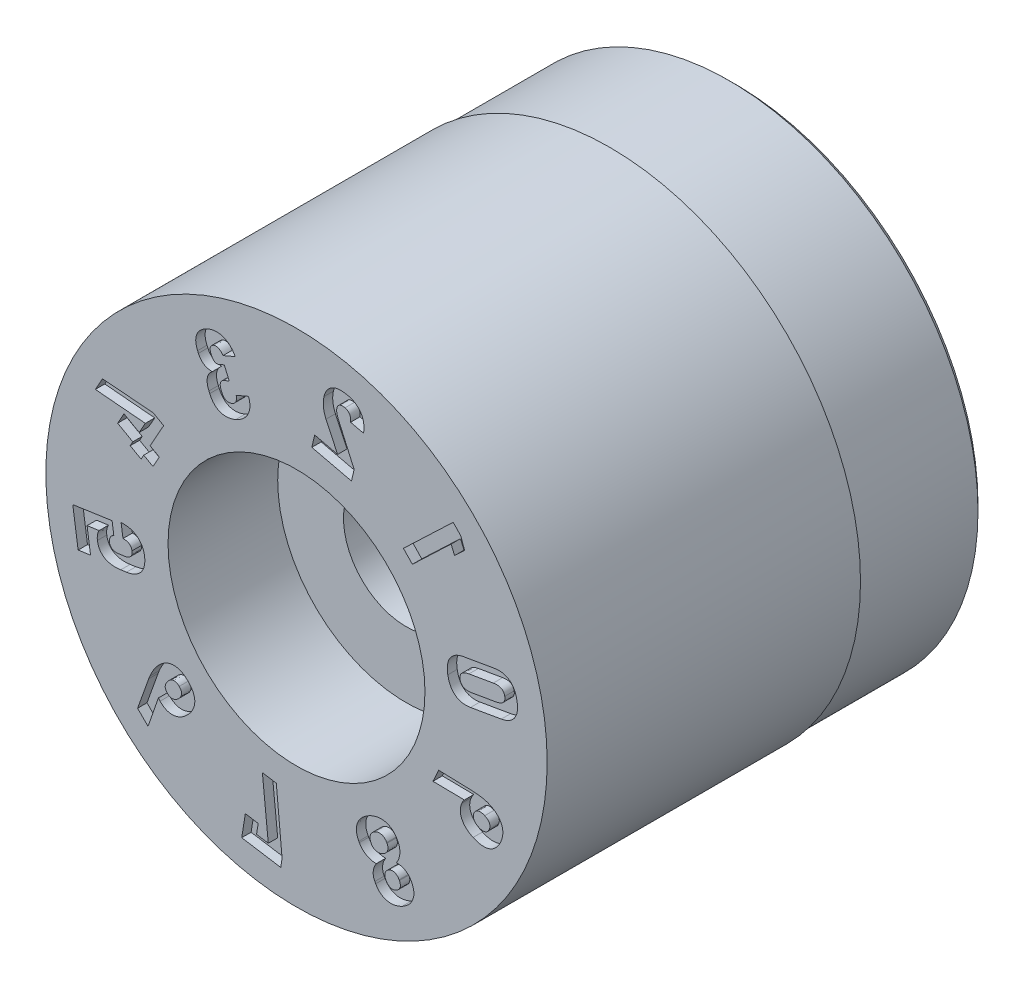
from build123d import *

# Parameters (mm, degrees)
SKETCH4_W          = 4
SKETCH4_H          = 1
CUT_EXTRUDE1_DEPTH = 0.3


with BuildPart() as part:
    # Sketch1 → Revolve1 (revolve)
    with BuildSketch(Plane(origin=(0, 0, 0), x_dir=(0, 0, -1), z_dir=(1, 0, 0)), mode=Mode.PRIVATE) as revolve1_sk:
        Polygon((0, 8), (0, 4.1), (3.5, 4.1), (3.5, 2), (14, 2), (14, 7.75), (13.75, 8), align=None)
    revolve(revolve1_sk.sketch.rotate(Axis((0, 0, 3.797909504), (0, 0, -1)), 90), axis=Axis((0, 0, 3.797909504), (0, 0, -1)))

    # Sketch4 → Cut-Revolve1 (revolve, cut)
    with BuildSketch(Plane(origin=(0, 0, 0), x_dir=(0, 0, -1), z_dir=(1, 0, 0)), mode=Mode.PRIVATE) as cut_revolve1_sk:
        with Locations((12, 8.435)):
            Rectangle(SKETCH4_W, SKETCH4_H)
    revolve(cut_revolve1_sk.sketch.rotate(Axis((0, 0, 0), (0, 0, -1)), 90), axis=Axis((0, 0, 0), (0, 0, -1)), mode=Mode.SUBTRACT)

    # Sketch6 → Cut-Extrude1 (cut)
    # profile 1 of 10: a face of its own
    with BuildSketch(Plane.XY):
        with BuildLine():
            Line((5.55422634, 0.29551817), (6.536308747, 0.465519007))
            add(Edge.make_bspline(
                [(6.536308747, 0.465519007), (6.582358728, 0.47294096), (6.648610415, 0.490139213), (6.73196451, 0.521902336), (6.787499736, 0.550627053), (6.838593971, 0.583022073), (6.884339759, 0.620402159), (6.925017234, 0.6625439), (6.961045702, 0.708597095), (6.991143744, 0.759268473), (7.015701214, 0.813627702), (7.034714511, 0.871713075), (7.0473586, 0.933811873), (7.053299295, 0.999644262), (7.055657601, 1.095087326), (7.046878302, 1.168307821), (7.038245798, 1.217849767)],
                knots=[0, 0, 0, 0, 0.135673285, 0.19880589, 0.259376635, 0.317443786, 0.37470943, 0.43096218, 0.487709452, 0.544606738, 0.602164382, 0.661102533, 0.72223516, 0.786286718, 0.853375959, 1, 1, 1, 1], degree=3))
            add(Edge.make_bspline(
                [(7.038245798, 1.217849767), (7.02979219, 1.267531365), (7.012248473, 1.339109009), (6.9800434, 1.429112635), (6.951379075, 1.488843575), (6.918790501, 1.543126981), (6.881684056, 1.59179115), (6.840526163, 1.635003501), (6.7949774, 1.672246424), (6.746085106, 1.703965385), (6.693537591, 1.729208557), (6.638054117, 1.749256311), (6.579026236, 1.762788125), (6.516850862, 1.77062367), (6.427393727, 1.772882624), (6.358867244, 1.766620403), (6.312715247, 1.757966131)],
                knots=[0, 0, 0, 0, 0.146552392, 0.213951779, 0.277770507, 0.338999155, 0.397856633, 0.45547227, 0.512221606, 0.568665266, 0.624627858, 0.681472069, 0.739968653, 0.800446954, 0.863510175, 1, 1, 1, 1], degree=3))
            Line((6.312715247, 1.757966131), (5.33063284, 1.587965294))
            add(Edge.make_bspline(
                [(5.33063284, 1.587965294), (5.28458286, 1.58054334), (5.218331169, 1.56334509), (5.134977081, 1.531581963), (5.079441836, 1.502857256), (5.028347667, 1.470462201), (4.98260164, 1.433082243), (4.941925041, 1.390940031), (4.905893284, 1.344888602), (4.875807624, 1.29421058), (4.85115414, 1.239768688), (4.832329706, 1.181538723), (4.820526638, 1.119352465), (4.813176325, 1.053715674), (4.812623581, 0.958327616), (4.820200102, 0.88521742), (4.829117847, 0.835785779)],
                knots=[0, 0, 0, 0, 0.135708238, 0.198857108, 0.259443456, 0.317525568, 0.374805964, 0.431073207, 0.487835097, 0.544747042, 0.602319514, 0.661617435, 0.722540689, 0.786404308, 0.853764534, 1, 1, 1, 1], degree=3))
            add(Edge.make_bspline(
                [(4.829117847, 0.835785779), (4.838187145, 0.78611769), (4.854327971, 0.713961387), (4.887481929, 0.624066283), (4.916676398, 0.564608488), (4.949042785, 0.510110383), (4.986719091, 0.461722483), (5.028265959, 0.418648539), (5.074229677, 0.381528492), (5.123702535, 0.350054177), (5.176323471, 0.324468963), (5.232129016, 0.30495926), (5.290886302, 0.291361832), (5.352626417, 0.283435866), (5.441042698, 0.280389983), (5.508626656, 0.287790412), (5.55422634, 0.29551817)],
                knots=[0, 0, 0, 0, 0.147216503, 0.214711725, 0.278663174, 0.339975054, 0.399045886, 0.45691866, 0.513969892, 0.570756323, 0.627410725, 0.68405676, 0.742632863, 0.802805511, 0.865144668, 1, 1, 1, 1], degree=3))
        make_face()
        with BuildLine():
            Line((5.505245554, 1.199046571), (6.279393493, 1.332634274))
            add(Edge.make_bspline(
                [(6.279393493, 1.332634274), (6.326021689, 1.340144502), (6.393686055, 1.347712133), (6.47836893, 1.336043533), (6.522573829, 1.321790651), (6.553354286, 1.305661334), (6.573406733, 1.290647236), (6.591713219, 1.273714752), (6.607443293, 1.253805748), (6.620543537, 1.231241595), (6.636122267, 1.197383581), (6.642976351, 1.169450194), (6.646226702, 1.150236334)],
                knots=[0, 0, 0, 0, 0.304768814, 0.431914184, 0.546788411, 0.601174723, 0.654439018, 0.707260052, 0.761006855, 0.816749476, 0.8745626, 1, 1, 1, 1], degree=3))
            add(Edge.make_bspline(
                [(6.646226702, 1.150236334), (6.649004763, 1.130985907), (6.652455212, 1.10237871), (6.649170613, 1.065176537), (6.644371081, 1.039519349), (6.635811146, 1.015668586), (6.624595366, 0.993415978), (6.610593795, 0.972506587), (6.587071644, 0.946681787), (6.550407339, 0.917882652), (6.474426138, 0.87844725), (6.408416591, 0.862174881), (6.361847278, 0.854015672)],
                knots=[0, 0, 0, 0, 0.125262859, 0.183200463, 0.239118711, 0.292288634, 0.345198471, 0.39871321, 0.453207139, 0.568752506, 0.695694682, 1, 1, 1, 1], degree=3))
            Line((6.361847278, 0.854015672), (5.587699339, 0.720427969))
            add(Edge.make_bspline(
                [(5.587699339, 0.720427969), (5.541191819, 0.712700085), (5.4737227, 0.705684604), (5.389011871, 0.71703972), (5.344874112, 0.73184054), (5.314033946, 0.747993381), (5.293907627, 0.762842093), (5.276131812, 0.780229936), (5.260313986, 0.799951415), (5.247250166, 0.822553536), (5.231657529, 0.856397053), (5.224812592, 0.884339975), (5.221559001, 0.903550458)],
                knots=[0, 0, 0, 0, 0.304087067, 0.431326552, 0.54688267, 0.60130924, 0.654612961, 0.707043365, 0.760829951, 0.816613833, 0.874469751, 1, 1, 1, 1], degree=3))
            add(Edge.make_bspline(
                [(5.221559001, 0.903550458), (5.218789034, 0.92280133), (5.215315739, 0.951407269), (5.218616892, 0.988406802), (5.223281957, 1.013975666), (5.231404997, 1.037904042), (5.242807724, 1.060056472), (5.256345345, 1.081116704), (5.279850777, 1.106784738), (5.316821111, 1.135071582), (5.392588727, 1.174724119), (5.45872288, 1.190822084), (5.505245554, 1.199046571)],
                knots=[0, 0, 0, 0, 0.125469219, 0.18350227, 0.23819574, 0.292201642, 0.345198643, 0.398029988, 0.452613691, 0.568042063, 0.695193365, 1, 1, 1, 1], degree=3))
        make_face(mode=Mode.SUBTRACT)
    # profile 2 of 10: a face of its own
    with BuildSketch(Plane.XY):
        Polygon((3.412413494, 3.623533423), (3.697664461, 3.323718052), (4.934647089, 4.501937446), (5.045752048, 4.239326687), (5.363477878, 4.542109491), (5.244435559, 4.881414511), (5.001020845, 5.136999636), align=None)
    # profile 3 of 10: a face of its own
    with BuildSketch(Plane.XY):
        with BuildLine():
            Line((1.839842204, 5.016540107), (1.333275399, 6.155334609))
            add(Edge.make_bspline(
                [(1.333275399, 6.155334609), (1.311295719, 6.203321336), (1.292016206, 6.266245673), (1.282880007, 6.342366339), (1.281876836, 6.387387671), (1.285305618, 6.420003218), (1.290043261, 6.440662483)],
                knots=[0, 0, 0, 0, 0.539921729, 0.665877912, 0.783522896, 1, 1, 1, 1], degree=3))
            Line((1.290043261, 6.440662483), (1.290845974, 6.443268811))
            add(Edge.make_bspline(
                [(1.290845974, 6.443268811), (1.297093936, 6.469209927), (1.311308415, 6.507021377), (1.346763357, 6.544882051), (1.37803121, 6.565484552), (1.414577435, 6.578603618), (1.472051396, 6.587705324), (1.51756218, 6.580429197), (1.548126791, 6.573727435)],
                knots=[0, 0, 0, 0, 0.246659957, 0.35800881, 0.470271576, 0.586521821, 0.711154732, 1, 1, 1, 1], degree=3))
            add(Edge.make_bspline(
                [(1.548126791, 6.573727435), (1.578969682, 6.566844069), (1.622576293, 6.548276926), (1.669594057, 6.507694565), (1.696215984, 6.470180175), (1.715621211, 6.426821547), (1.731652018, 6.358465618), (1.730697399, 6.30354298), (1.726091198, 6.266107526)],
                knots=[0, 0, 0, 0, 0.240293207, 0.353106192, 0.468570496, 0.587390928, 0.712468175, 1, 1, 1, 1], degree=3))
            Line((1.726091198, 6.266107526), (1.725890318, 6.264704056))
            Line((1.725890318, 6.264704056), (2.139302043, 6.167148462))
            Line((2.139302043, 6.167148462), (2.139502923, 6.168551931))
            add(Edge.make_bspline(
                [(2.139502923, 6.168551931), (2.150543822, 6.232350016), (2.157445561, 6.327106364), (2.145844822, 6.450164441), (2.126311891, 6.5347605), (2.097320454, 6.613788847), (2.058286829, 6.686123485), (2.010234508, 6.751749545), (1.95280374, 6.810132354), (1.886578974, 6.860588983), (1.786237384, 6.919252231), (1.70156657, 6.947344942), (1.643269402, 6.961274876)],
                knots=[0, 0, 0, 0, 0.185860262, 0.271096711, 0.354000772, 0.434451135, 0.512067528, 0.589212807, 0.667237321, 0.746341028, 0.82760204, 1, 1, 1, 1], degree=3))
            add(Edge.make_bspline(
                [(1.643269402, 6.961274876), (1.581171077, 6.976228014), (1.488883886, 6.990124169), (1.368483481, 6.989087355), (1.286715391, 6.978099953), (1.210671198, 6.95798363), (1.141154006, 6.927458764), (1.078361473, 6.887367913), (1.022749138, 6.837633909), (0.974334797, 6.779060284), (0.918731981, 6.686636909), (0.891719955, 6.608031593), (0.878640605, 6.553255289)],
                knots=[0, 0, 0, 0, 0.194838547, 0.283119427, 0.366441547, 0.445864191, 0.522264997, 0.597081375, 0.6721653, 0.748905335, 0.828025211, 1, 1, 1, 1], degree=3))
            Line((0.878640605, 6.553255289), (0.878239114, 6.551450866))
            add(Edge.make_bspline(
                [(0.878239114, 6.551450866), (0.866395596, 6.502858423), (0.856186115, 6.428122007), (0.854396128, 6.327004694), (0.859917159, 6.250297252), (0.871329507, 6.174105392), (0.893786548, 6.074679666), (0.920831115, 6.003232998), (0.94183966, 5.957141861)],
                knots=[0, 0, 0, 0, 0.246311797, 0.370558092, 0.498065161, 0.625011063, 0.750110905, 1, 1, 1, 1], degree=3))
            Line((0.94183966, 5.957141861), (1.311556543, 5.168061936))
            Line((1.311556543, 5.168061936), (0.580166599, 5.34049063))
            Line((0.580166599, 5.34049063), (0.488632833, 4.952140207))
            Line((0.488632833, 4.952140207), (1.753929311, 4.653451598))
            Line((1.753929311, 4.653451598), (1.839842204, 5.016540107))
        make_face()
    # profile 4 of 10: a face of its own
    with BuildSketch(Plane.XY):
        with BuildLine():
            Line((-1.533307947, 5.351864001), (-1.925607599, 5.182846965))
            add(Edge.make_bspline(
                [(-1.925607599, 5.182846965), (-1.919582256, 5.162153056), (-1.914749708, 5.131013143), (-1.913037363, 5.089942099), (-1.916141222, 5.061176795), (-1.922610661, 5.033901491), (-1.932558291, 5.008518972), (-1.944903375, 4.984490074), (-1.960871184, 4.962585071), (-1.979784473, 4.942505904), (-2.009737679, 4.918419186), (-2.035033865, 4.903445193), (-2.053566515, 4.896019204)],
                knots=[0, 0, 0, 0, 0.185865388, 0.271782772, 0.354772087, 0.435257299, 0.513511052, 0.590037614, 0.668280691, 0.747130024, 0.827936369, 1, 1, 1, 1], degree=3))
            add(Edge.make_bspline(
                [(-2.053566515, 4.896019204), (-2.08594833, 4.881870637), (-2.136037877, 4.867335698), (-2.202792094, 4.869921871), (-2.247442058, 4.882719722), (-2.288506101, 4.905019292), (-2.338423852, 4.95046573), (-2.364945, 4.995894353), (-2.379216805, 5.028590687)],
                knots=[0, 0, 0, 0, 0.266347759, 0.383343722, 0.497306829, 0.61219478, 0.731219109, 1, 1, 1, 1], degree=3))
            Line((-2.379216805, 5.028590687), (-2.399572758, 5.075588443))
            add(Edge.make_bspline(
                [(-2.399572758, 5.075588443), (-2.414008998, 5.109902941), (-2.431356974, 5.161029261), (-2.435611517, 5.22920742), (-2.429698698, 5.273424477), (-2.415348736, 5.313428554), (-2.382059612, 5.360056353), (-2.345250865, 5.384321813), (-2.318213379, 5.395352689)],
                knots=[0, 0, 0, 0, 0.300132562, 0.42747231, 0.545361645, 0.656146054, 0.765280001, 1, 1, 1, 1], degree=3))
            Line((-2.318213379, 5.395352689), (-2.148079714, 5.468977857))
            Line((-2.148079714, 5.468977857), (-2.305878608, 5.8346365))
            Line((-2.305878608, 5.8346365), (-2.476012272, 5.761011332))
            add(Edge.make_bspline(
                [(-2.476012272, 5.761011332), (-2.497987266, 5.751550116), (-2.533653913, 5.743481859), (-2.580389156, 5.752050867), (-2.612869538, 5.767317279), (-2.642911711, 5.790823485), (-2.682675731, 5.833665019), (-2.703639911, 5.874967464), (-2.716640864, 5.903912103)],
                knots=[0, 0, 0, 0, 0.228705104, 0.335559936, 0.446597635, 0.566693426, 0.696337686, 1, 1, 1, 1], degree=3))
            Line((-2.716640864, 5.903912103), (-2.731586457, 5.939010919))
            add(Edge.make_bspline(
                [(-2.731586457, 5.939010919), (-2.74327599, 5.966643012), (-2.757172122, 6.008505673), (-2.758072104, 6.064402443), (-2.751164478, 6.10110071), (-2.737141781, 6.134507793), (-2.706137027, 6.174022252), (-2.673329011, 6.194825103), (-2.649339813, 6.204884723)],
                knots=[0, 0, 0, 0, 0.286802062, 0.411383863, 0.527644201, 0.639552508, 0.752358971, 1, 1, 1, 1], degree=3))
            add(Edge.make_bspline(
                [(-2.649339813, 6.204884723), (-2.632731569, 6.211772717), (-2.60674922, 6.21941292), (-2.570882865, 6.221666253), (-2.544010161, 6.21961199), (-2.517091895, 6.213497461), (-2.490594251, 6.203808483), (-2.464451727, 6.190202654), (-2.438847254, 6.173335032), (-2.414002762, 6.152821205), (-2.38102722, 6.120080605), (-2.36013831, 6.090822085), (-2.346162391, 6.070727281)],
                knots=[0, 0, 0, 0, 0.149222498, 0.221968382, 0.296834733, 0.371823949, 0.450057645, 0.530027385, 0.615559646, 0.703724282, 0.796658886, 1, 1, 1, 1], degree=3))
            Line((-2.346162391, 6.070727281), (-1.955112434, 6.239074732))
            add(Edge.make_bspline(
                [(-1.955112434, 6.239074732), (-1.985076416, 6.295157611), (-2.037465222, 6.3730576), (-2.122220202, 6.46117351), (-2.189446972, 6.51580891), (-2.261467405, 6.559406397), (-2.336244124, 6.593431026), (-2.414382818, 6.615872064), (-2.494836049, 6.627294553), (-2.57687241, 6.629155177), (-2.688170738, 6.615349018), (-2.769761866, 6.591229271), (-2.821970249, 6.567904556)],
                knots=[0, 0, 0, 0, 0.185508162, 0.27192042, 0.355882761, 0.437457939, 0.516877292, 0.594873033, 0.673735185, 0.753357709, 0.833516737, 1, 1, 1, 1], degree=3))
            add(Edge.make_bspline(
                [(-2.821970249, 6.567904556), (-2.864483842, 6.550249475), (-2.924035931, 6.518926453), (-2.99727987, 6.47114474), (-3.04460861, 6.432776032), (-3.086423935, 6.391950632), (-3.122861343, 6.348540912), (-3.15285908, 6.301942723), (-3.178085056, 6.253413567), (-3.197110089, 6.202530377), (-3.209487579, 6.14970919), (-3.216278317, 6.095406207), (-3.216933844, 6.039423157), (-3.210950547, 5.981997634), (-3.194598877, 5.901313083), (-3.173371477, 5.841669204), (-3.156506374, 5.802056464)],
                knots=[0, 0, 0, 0, 0.145060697, 0.211857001, 0.275608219, 0.336951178, 0.396011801, 0.454001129, 0.511451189, 0.568288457, 0.624902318, 0.682241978, 0.740636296, 0.801139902, 0.864066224, 1, 1, 1, 1], degree=3))
            Line((-3.156506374, 5.802056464), (-3.130360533, 5.740950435))
            add(Edge.make_bspline(
                [(-3.130360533, 5.740950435), (-3.111430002, 5.69680962), (-3.075044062, 5.634879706), (-3.00981015, 5.567109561), (-2.955017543, 5.526025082), (-2.89468466, 5.493582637), (-2.805477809, 5.463925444), (-2.734064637, 5.457000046), (-2.685988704, 5.458547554)],
                knots=[0, 0, 0, 0, 0.256654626, 0.378900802, 0.500184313, 0.62100998, 0.743149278, 1, 1, 1, 1], degree=3))
            add(Edge.make_bspline(
                [(-2.685988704, 5.458547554), (-2.707584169, 5.443626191), (-2.736381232, 5.417383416), (-2.770761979, 5.379234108), (-2.791942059, 5.348351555), (-2.810877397, 5.316419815), (-2.825429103, 5.282128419), (-2.837819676, 5.24641422), (-2.846014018, 5.208775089), (-2.851126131, 5.169901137), (-2.85380679, 5.129974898), (-2.852014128, 5.088953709), (-2.847346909, 5.0470215), (-2.839551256, 5.004029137), (-2.823113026, 4.944579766), (-2.807581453, 4.899958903), (-2.794347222, 4.870663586)],
                knots=[0, 0, 0, 0, 0.120558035, 0.179135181, 0.236211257, 0.292840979, 0.349917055, 0.407543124, 0.466836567, 0.527042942, 0.588152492, 0.650976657, 0.715968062, 0.782502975, 0.852076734, 1, 1, 1, 1], degree=3))
            Line((-2.794347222, 4.870663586), (-2.768201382, 4.809557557))
            add(Edge.make_bspline(
                [(-2.768201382, 4.809557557), (-2.7449656, 4.754549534), (-2.702481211, 4.677923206), (-2.62996656, 4.590480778), (-2.570808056, 4.537583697), (-2.506287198, 4.495239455), (-2.437022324, 4.463167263), (-2.362553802, 4.443085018), (-2.283768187, 4.434191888), (-2.20103413, 4.435496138), (-2.082517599, 4.454089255), (-1.994571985, 4.48374861), (-1.936391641, 4.508915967)],
                knots=[0, 0, 0, 0, 0.178150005, 0.259397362, 0.337905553, 0.413999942, 0.488873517, 0.56467471, 0.643062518, 0.724728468, 0.810803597, 1, 1, 1, 1], degree=3))
            add(Edge.make_bspline(
                [(-1.936391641, 4.508915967), (-1.878123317, 4.53341334), (-1.796691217, 4.578854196), (-1.700136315, 4.653212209), (-1.638527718, 4.714373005), (-1.586693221, 4.780853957), (-1.544626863, 4.852120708), (-1.51389099, 4.928191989), (-1.493317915, 5.008280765), (-1.484445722, 5.091656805), (-1.49001307, 5.208509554), (-1.51200265, 5.295317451), (-1.533307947, 5.351864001)],
                knots=[0, 0, 0, 0, 0.181400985, 0.266539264, 0.349449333, 0.430114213, 0.508126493, 0.586428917, 0.665042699, 0.744995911, 0.826374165, 1, 1, 1, 1], degree=3))
        make_face()
    # profile 5 of 10: a face of its own
    with BuildSketch(Plane.XY):
        Polygon((-4.571023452, 3.374225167), (-6.189931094, 3.507632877), (-6.419369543, 3.099385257), (-4.825249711, 2.959264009), (-5.021114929, 2.610381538), (-5.505727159, 2.882490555), (-5.708362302, 2.521569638), (-5.223741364, 2.249455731), (-5.308035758, 2.099307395), (-4.960391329, 1.903804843), (-4.87596057, 2.054177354), (-4.580821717, 1.888457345), (-4.378186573, 2.249378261), (-4.673314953, 2.415092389), (-4.239437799, 3.187834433), align=None)
    # profile 6 of 10: a face of its own
    with BuildSketch(Plane.XY):
        with BuildLine():
            Line((-5.596320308, -0.170542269), (-5.598166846, -0.170628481))
            Line((-5.598166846, -0.170628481), (-5.538489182, -0.5814975))
            Line((-5.538489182, -0.5814975), (-5.536642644, -0.581411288))
            add(Edge.make_bspline(
                [(-5.536642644, -0.581411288), (-5.499917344, -0.58029467), (-5.445925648, -0.58216419), (-5.380259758, -0.60354255), (-5.339035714, -0.625780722), (-5.304390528, -0.655029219), (-5.266955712, -0.703048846), (-5.253986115, -0.74815684), (-5.249103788, -0.778297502)],
                knots=[0, 0, 0, 0, 0.286362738, 0.412043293, 0.532487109, 0.647222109, 0.761276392, 1, 1, 1, 1], degree=3))
            add(Edge.make_bspline(
                [(-5.249103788, -0.778297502), (-5.24400425, -0.810583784), (-5.244225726, -0.859853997), (-5.267385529, -0.91919829), (-5.294183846, -0.957024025), (-5.329976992, -0.989085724), (-5.392474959, -1.02462422), (-5.44747141, -1.03801002), (-5.485888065, -1.04364183)],
                knots=[0, 0, 0, 0, 0.244128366, 0.355732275, 0.468896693, 0.585718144, 0.710251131, 1, 1, 1, 1], degree=3))
            Line((-5.485888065, -1.04364183), (-5.668820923, -1.070470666))
            add(Edge.make_bspline(
                [(-5.668820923, -1.070470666), (-5.707193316, -1.076146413), (-5.763035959, -1.078611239), (-5.832871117, -1.065911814), (-5.875465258, -1.04778964), (-5.911009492, -1.022843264), (-5.948722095, -0.978692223), (-5.962639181, -0.936228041), (-5.966874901, -0.907167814)],
                knots=[0, 0, 0, 0, 0.303244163, 0.432821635, 0.551410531, 0.662147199, 0.769353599, 1, 1, 1, 1], degree=3))
            add(Edge.make_bspline(
                [(-5.966874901, -0.907167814), (-5.97113081, -0.879583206), (-5.972035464, -0.838154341), (-5.959850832, -0.785484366), (-5.944876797, -0.749611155), (-5.924197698, -0.716951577), (-5.888203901, -0.678539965), (-5.854746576, -0.656464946), (-5.830061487, -0.645620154)],
                knots=[0, 0, 0, 0, 0.263060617, 0.384723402, 0.506711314, 0.627450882, 0.746680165, 1, 1, 1, 1], degree=3))
            Line((-5.830061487, -0.645620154), (-5.886298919, -0.261804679))
            Line((-5.886298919, -0.261804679), (-7.140162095, -0.444878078))
            Line((-7.140162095, -0.444878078), (-6.96934214, -1.615820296))
            Line((-6.96934214, -1.615820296), (-6.573417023, -1.557820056))
            Line((-6.573417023, -1.557820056), (-6.684129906, -0.797617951))
            Line((-6.684129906, -0.797617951), (-6.298897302, -0.741423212))
            add(Edge.make_bspline(
                [(-6.298897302, -0.741423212), (-6.31216854, -0.760232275), (-6.328692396, -0.79217451), (-6.344210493, -0.839179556), (-6.36057553, -0.918788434), (-6.362685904, -0.987966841), (-6.354627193, -1.042292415)],
                knots=[0, 0, 0, 0, 0.220581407, 0.343194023, 0.474209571, 1, 1, 1, 1], degree=3))
            add(Edge.make_bspline(
                [(-6.354627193, -1.042292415), (-6.346891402, -1.095111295), (-6.327279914, -1.171798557), (-6.279149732, -1.262698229), (-6.235716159, -1.321789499), (-6.183479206, -1.372918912), (-6.122782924, -1.415095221), (-6.054462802, -1.448910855), (-5.978373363, -1.473205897), (-5.895384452, -1.489836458), (-5.771039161, -1.498173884), (-5.674612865, -1.492028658), (-5.609014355, -1.481769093)],
                knots=[0, 0, 0, 0, 0.163638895, 0.239143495, 0.313484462, 0.387162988, 0.461715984, 0.538709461, 0.619508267, 0.705416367, 0.797039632, 1, 1, 1, 1], degree=3))
            Line((-5.609014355, -1.481769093), (-5.426081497, -1.454940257))
            add(Edge.make_bspline(
                [(-5.426081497, -1.454940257), (-5.36062146, -1.444882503), (-5.265377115, -1.424106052), (-5.150350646, -1.373420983), (-5.075768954, -1.328777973), (-5.011133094, -1.275791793), (-4.955440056, -1.216070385), (-4.911085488, -1.147963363), (-4.877202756, -1.073083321), (-4.853282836, -0.991726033), (-4.837152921, -0.871026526), (-4.841622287, -0.777070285), (-4.851419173, -0.713683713)],
                knots=[0, 0, 0, 0, 0.186821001, 0.272017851, 0.352817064, 0.430697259, 0.506513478, 0.581749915, 0.658355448, 0.737106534, 0.819540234, 1, 1, 1, 1], degree=3))
            add(Edge.make_bspline(
                [(-4.851419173, -0.713683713), (-4.858895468, -0.657461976), (-4.880869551, -0.576041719), (-4.928259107, -0.47579119), (-4.973066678, -0.408540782), (-5.025884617, -0.348017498), (-5.087124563, -0.295550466), (-5.156162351, -0.251205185), (-5.232757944, -0.215662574), (-5.31570353, -0.189078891), (-5.437185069, -0.166344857), (-5.532095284, -0.16535337), (-5.596320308, -0.170542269)],
                knots=[0, 0, 0, 0, 0.165459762, 0.244568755, 0.323027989, 0.400794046, 0.478555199, 0.557836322, 0.639786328, 0.724566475, 0.811668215, 1, 1, 1, 1], degree=3))
        make_face()
    # profile 7 of 10: a face of its own
    with BuildSketch(Plane.XY):
        with BuildLine():
            Line((-4.389981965, -3.502491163), (-4.391323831, -3.503839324))
            add(Edge.make_bspline(
                [(-4.391323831, -3.503839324), (-4.420351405, -3.533360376), (-4.462351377, -3.580574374), (-4.513307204, -3.649231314), (-4.590555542, -3.763866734), (-4.644054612, -3.868028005), (-4.680793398, -3.954650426)],
                knots=[0, 0, 0, 0, 0.230544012, 0.35120083, 0.475829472, 1, 1, 1, 1], degree=3))
            add(Edge.make_bspline(
                [(-4.680793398, -3.954650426), (-4.687367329, -3.970128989), (-4.700123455, -4.00040863), (-4.711092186, -4.031385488), (-4.715997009, -4.046642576)],
                knots=[0, 0, 0, 0, 0.512074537, 1, 1, 1, 1], degree=3))
            Line((-4.715997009, -4.046642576), (-5.071899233, -5.038755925))
            Line((-5.071899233, -5.038755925), (-4.738450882, -5.371989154))
            Line((-4.738450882, -5.371989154), (-4.407211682, -4.421616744))
            add(Edge.make_bspline(
                [(-4.407211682, -4.421616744), (-4.392196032, -4.444229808), (-4.374628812, -4.465151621), (-4.355403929, -4.484275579)],
                knots=[0.757795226, 0.757795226, 0.757795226, 0.757795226, 1, 1, 1, 1], degree=3))
            add(Edge.make_bspline(
                [(-4.355403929, -4.484275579), (-4.315775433, -4.52550665), (-4.249621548, -4.576800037), (-4.153563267, -4.62811263), (-4.080673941, -4.652129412), (-4.006422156, -4.664733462), (-3.931010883, -4.665589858), (-3.854999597, -4.65354501), (-3.778356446, -4.630855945), (-3.701976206, -4.595976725), (-3.597190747, -4.532914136), (-3.525936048, -4.470290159), (-3.479934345, -4.424839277)],
                knots=[0, 0, 0, 0, 0.171700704, 0.250398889, 0.326813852, 0.40168016, 0.476384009, 0.55281487, 0.632553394, 0.716348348, 0.804942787, 1, 1, 1, 1], degree=3))
            Line((-3.479934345, -4.424839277), (-3.478592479, -4.423491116))
            add(Edge.make_bspline(
                [(-3.478592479, -4.423491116), (-3.431626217, -4.37662417), (-3.368617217, -4.302448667), (-3.306417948, -4.193273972), (-3.272723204, -4.113090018), (-3.252307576, -4.031857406), (-3.243377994, -3.950718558), (-3.248339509, -3.869894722), (-3.265883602, -3.789699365), (-3.296040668, -3.710600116), (-3.354334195, -3.603840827), (-3.415103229, -3.532104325), (-3.460160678, -3.486865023)],
                knots=[0, 0, 0, 0, 0.187135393, 0.271987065, 0.353139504, 0.431351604, 0.507130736, 0.582183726, 0.658395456, 0.73752667, 0.819842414, 1, 1, 1, 1], degree=3))
            add(Edge.make_bspline(
                [(-3.460160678, -3.486865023), (-3.504646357, -3.441669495), (-3.576533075, -3.382314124), (-3.682257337, -3.323620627), (-3.76147748, -3.294247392), (-3.841240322, -3.275727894), (-3.921806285, -3.271241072), (-4.00237863, -3.278568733), (-4.082848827, -3.29890155), (-4.16225449, -3.331759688), (-4.270162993, -3.393662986), (-4.343683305, -3.455768), (-4.389981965, -3.502491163)],
                knots=[0, 0, 0, 0, 0.179948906, 0.262714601, 0.342044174, 0.419011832, 0.494231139, 0.570034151, 0.647805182, 0.728853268, 0.813186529, 1, 1, 1, 1], degree=3))
        make_face()
        with BuildLine():
            Line((-3.75550304, -4.110300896), (-3.756844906, -4.111649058))
            add(Edge.make_bspline(
                [(-3.756844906, -4.111649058), (-3.785448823, -4.14063302), (-3.831187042, -4.178006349), (-3.899125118, -4.209659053), (-3.947473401, -4.220606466), (-3.994809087, -4.219856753), (-4.05777745, -4.203470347), (-4.098596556, -4.173589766), (-4.122153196, -4.149716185)],
                knots=[0, 0, 0, 0, 0.293565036, 0.419712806, 0.53638754, 0.647202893, 0.757305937, 1, 1, 1, 1], degree=3))
            add(Edge.make_bspline(
                [(-4.122153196, -4.149716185), (-4.145807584, -4.126599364), (-4.174568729, -4.085963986), (-4.190859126, -4.023395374), (-4.190496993, -3.975771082), (-4.179701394, -3.92703125), (-4.1473316, -3.859142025), (-4.111348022, -3.812482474), (-4.081761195, -3.784224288)],
                knots=[0, 0, 0, 0, 0.238902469, 0.348908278, 0.460952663, 0.579093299, 0.705882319, 1, 1, 1, 1], degree=3))
            Line((-4.081761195, -3.784224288), (-4.080866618, -3.783325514))
            add(Edge.make_bspline(
                [(-4.080866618, -3.783325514), (-4.055743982, -3.758456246), (-4.015584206, -3.725430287), (-3.953898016, -3.701797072), (-3.909533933, -3.695220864), (-3.865370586, -3.698509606), (-3.806083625, -3.718815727), (-3.767204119, -3.747870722), (-3.744191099, -3.771329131)],
                knots=[0, 0, 0, 0, 0.278622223, 0.398676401, 0.513434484, 0.627401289, 0.742189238, 1, 1, 1, 1], degree=3))
            add(Edge.make_bspline(
                [(-3.744191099, -3.771329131), (-3.720004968, -3.794448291), (-3.690477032, -3.834014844), (-3.669877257, -3.894124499), (-3.666923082, -3.938738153), (-3.673499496, -3.983410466), (-3.698455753, -4.044746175), (-3.730631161, -4.085189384), (-3.75550304, -4.110300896)],
                knots=[0, 0, 0, 0, 0.260141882, 0.376267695, 0.489281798, 0.604491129, 0.724471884, 1, 1, 1, 1], degree=3))
        make_face(mode=Mode.SUBTRACT)
    # profile 8 of 10: a face of its own
    with BuildSketch(Plane.XY):
        Polygon((-0.459629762, -6.881534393), (-0.644086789, -4.897218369), (-1.089588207, -4.825900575), (-0.90025364, -6.685419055), (-1.274934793, -6.625418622), (-1.222577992, -6.297289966), (-1.633165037, -6.231704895), (-1.748648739, -6.955659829), (-0.502979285, -7.154595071), align=None)
    # profile 9 of 10: a face of its own
    with BuildSketch(Plane.XY):
        with BuildLine():
            Line((1.988169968, -5.183422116), (2.005268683, -5.215221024))
            add(Edge.make_bspline(
                [(2.005268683, -5.215221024), (2.03035125, -5.263125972), (2.079336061, -5.328805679), (2.161185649, -5.40145406), (2.231050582, -5.446751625), (2.305924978, -5.483404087), (2.410824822, -5.517655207), (2.493405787, -5.525843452), (2.548158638, -5.523394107)],
                knots=[0, 0, 0, 0, 0.246328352, 0.370330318, 0.497931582, 0.625313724, 0.749974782, 1, 1, 1, 1], degree=3))
            add(Edge.make_bspline(
                [(2.548158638, -5.523394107), (2.52086389, -5.561498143), (2.486438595, -5.623382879), (2.459915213, -5.713165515), (2.448668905, -5.781810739), (2.445992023, -5.850464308), (2.456762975, -5.938913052), (2.478117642, -6.001869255), (2.499570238, -6.040028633)],
                knots=[0, 0, 0, 0, 0.257650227, 0.384611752, 0.512448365, 0.638859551, 0.760554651, 1, 1, 1, 1], degree=3))
            Line((2.499570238, -6.040028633), (2.526654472, -6.090832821))
            add(Edge.make_bspline(
                [(2.526654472, -6.090832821), (2.552407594, -6.138692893), (2.598204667, -6.205614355), (2.676323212, -6.277403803), (2.739834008, -6.320779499), (2.80864576, -6.353787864), (2.88146405, -6.377327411), (2.958367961, -6.389481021), (3.038584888, -6.391425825), (3.120972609, -6.382175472), (3.235763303, -6.355900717), (3.318851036, -6.319788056), (3.373110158, -6.291091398)],
                knots=[0, 0, 0, 0, 0.166895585, 0.245774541, 0.324140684, 0.401844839, 0.479016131, 0.557976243, 0.639727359, 0.724333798, 0.811527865, 1, 1, 1, 1], degree=3))
            add(Edge.make_bspline(
                [(3.373110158, -6.291091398), (3.427549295, -6.262794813), (3.502251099, -6.212084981), (3.588804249, -6.132266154), (3.6415753, -6.06809184), (3.684161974, -6.000111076), (3.716300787, -5.92919207), (3.737393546, -5.85549496), (3.747749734, -5.779813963), (3.74695878, -5.702712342), (3.729316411, -5.598048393), (3.699941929, -5.522532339), (3.673901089, -5.474776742)],
                knots=[0, 0, 0, 0, 0.187785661, 0.275345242, 0.360085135, 0.441660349, 0.520587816, 0.597955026, 0.675813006, 0.753956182, 0.833372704, 1, 1, 1, 1], degree=3))
            Line((3.673901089, -5.474776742), (3.646816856, -5.423972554))
            add(Edge.make_bspline(
                [(3.646816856, -5.423972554), (3.625607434, -5.385037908), (3.585565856, -5.330640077), (3.516141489, -5.273321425), (3.457220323, -5.23770096), (3.393428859, -5.209693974), (3.303253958, -5.184143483), (3.232703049, -5.17896971), (3.185753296, -5.18141659)],
                knots=[0, 0, 0, 0, 0.242338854, 0.363857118, 0.489664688, 0.617294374, 0.743276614, 1, 1, 1, 1], degree=3))
            add(Edge.make_bspline(
                [(3.185753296, -5.18141659), (3.218530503, -5.136685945), (3.256258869, -5.062298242), (3.287586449, -4.955625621), (3.298996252, -4.872605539), (3.300230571, -4.789239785), (3.285663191, -4.680953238), (3.258153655, -4.603972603), (3.23251008, -4.556479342)],
                knots=[0, 0, 0, 0, 0.251609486, 0.376385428, 0.50447501, 0.631825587, 0.754746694, 1, 1, 1, 1], degree=3))
            Line((3.23251008, -4.556479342), (3.215411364, -4.524680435))
            add(Edge.make_bspline(
                [(3.215411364, -4.524680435), (3.188488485, -4.473554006), (3.138834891, -4.403325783), (3.056288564, -4.326773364), (2.988808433, -4.280845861), (2.915570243, -4.245846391), (2.837782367, -4.221925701), (2.755909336, -4.20906875), (2.670428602, -4.207788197), (2.582313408, -4.217538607), (2.45984442, -4.247358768), (2.370747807, -4.284979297), (2.312983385, -4.316326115)],
                knots=[0, 0, 0, 0, 0.166231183, 0.245085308, 0.322951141, 0.400273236, 0.477859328, 0.556396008, 0.638019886, 0.723225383, 0.810881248, 1, 1, 1, 1], degree=3))
            add(Edge.make_bspline(
                [(2.312983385, -4.316326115), (2.255181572, -4.347466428), (2.174374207, -4.400453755), (2.081967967, -4.485932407), (2.025671, -4.554193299), (1.978957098, -4.625811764), (1.944769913, -4.701430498), (1.921433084, -4.779440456), (1.910373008, -4.859900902), (1.911507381, -4.941416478), (1.928225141, -5.052806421), (1.961503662, -5.132357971), (1.988169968, -5.183422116)],
                knots=[0, 0, 0, 0, 0.189078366, 0.276648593, 0.361473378, 0.443243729, 0.522124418, 0.599573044, 0.676943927, 0.755001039, 0.833590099, 1, 1, 1, 1], degree=3))
        make_face()
        with BuildLine():
            Line((2.878925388, -4.77379433), (2.888785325, -4.792178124))
            add(Edge.make_bspline(
                [(2.888785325, -4.792178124), (2.899969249, -4.812877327), (2.91266563, -4.845335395), (2.920209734, -4.890384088), (2.920337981, -4.923400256), (2.915544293, -4.955984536), (2.90577403, -4.987476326), (2.892115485, -5.018161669), (2.873503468, -5.047427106), (2.850890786, -5.075336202), (2.813310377, -5.109830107), (2.780932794, -5.131642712), (2.757427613, -5.144092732)],
                knots=[0, 0, 0, 0, 0.167101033, 0.245234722, 0.32326736, 0.400683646, 0.478274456, 0.556818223, 0.638596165, 0.723955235, 0.81125327, 1, 1, 1, 1], degree=3))
            add(Edge.make_bspline(
                [(2.757427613, -5.144092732), (2.733839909, -5.156362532), (2.698122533, -5.172283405), (2.648480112, -5.183690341), (2.61294524, -5.18735742), (2.578197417, -5.186675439), (2.54495067, -5.181330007), (2.513111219, -5.17186758), (2.483285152, -5.157400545), (2.455861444, -5.138438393), (2.421462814, -5.107859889), (2.401812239, -5.078520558), (2.39068081, -5.057778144)],
                knots=[0, 0, 0, 0, 0.188625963, 0.274697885, 0.359643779, 0.440960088, 0.520035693, 0.597364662, 0.675328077, 0.753635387, 0.832795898, 1, 1, 1, 1], degree=3))
            Line((2.39068081, -5.057778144), (2.379948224, -5.03827696))
            add(Edge.make_bspline(
                [(2.379948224, -5.03827696), (2.368625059, -5.015698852), (2.35340645, -4.981102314), (2.345186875, -4.932516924), (2.343713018, -4.897083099), (2.347521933, -4.86232951), (2.355565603, -4.828515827), (2.368984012, -4.796193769), (2.387357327, -4.76567337), (2.409450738, -4.736885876), (2.446019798, -4.701485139), (2.478198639, -4.679676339), (2.501693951, -4.667605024)],
                knots=[0, 0, 0, 0, 0.173392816, 0.255038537, 0.335545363, 0.415041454, 0.493234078, 0.572361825, 0.653159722, 0.736123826, 0.819664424, 1, 1, 1, 1], degree=3))
            add(Edge.make_bspline(
                [(2.501693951, -4.667605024), (2.524636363, -4.654635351), (2.560816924, -4.64037722), (2.61067909, -4.629425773), (2.647263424, -4.627039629), (2.683072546, -4.629051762), (2.717562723, -4.636073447), (2.750300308, -4.648277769), (2.781607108, -4.664377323), (2.810026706, -4.685899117), (2.846072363, -4.719700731), (2.866767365, -4.751524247), (2.878925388, -4.77379433)],
                knots=[0, 0, 0, 0, 0.178896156, 0.263035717, 0.346434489, 0.427544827, 0.506483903, 0.584923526, 0.664664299, 0.745108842, 0.826702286, 1, 1, 1, 1], degree=3))
        make_face(mode=Mode.SUBTRACT)
        with BuildLine():
            Line((3.274384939, -5.605637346), (3.284244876, -5.62402114))
            add(Edge.make_bspline(
                [(3.284244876, -5.62402114), (3.294953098, -5.643225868), (3.30650873, -5.673520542), (3.314712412, -5.715056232), (3.316306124, -5.74524318), (3.313533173, -5.774797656), (3.306382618, -5.80314455), (3.296166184, -5.830632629), (3.280930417, -5.856295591), (3.262272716, -5.880447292), (3.231549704, -5.910704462), (3.20427531, -5.929369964), (3.184399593, -5.939812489)],
                knots=[0, 0, 0, 0, 0.176515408, 0.259000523, 0.339811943, 0.41889598, 0.496875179, 0.574482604, 0.653995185, 0.735987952, 0.819475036, 1, 1, 1, 1], degree=3))
            add(Edge.make_bspline(
                [(3.184399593, -5.939812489), (3.164546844, -5.950021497), (3.134349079, -5.96371514), (3.092033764, -5.972002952), (3.061496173, -5.974537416), (3.031481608, -5.97237149), (3.00255129, -5.966398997), (2.97519257, -5.955518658), (2.94883111, -5.941584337), (2.924555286, -5.92303139), (2.894177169, -5.893267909), (2.875641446, -5.866503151), (2.865513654, -5.847061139)],
                knots=[0, 0, 0, 0, 0.179666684, 0.262681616, 0.344635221, 0.424576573, 0.503105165, 0.580418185, 0.659810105, 0.74141273, 0.824349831, 1, 1, 1, 1], degree=3))
            Line((2.865513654, -5.847061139), (2.85502902, -5.82718642))
            add(Edge.make_bspline(
                [(2.85502902, -5.82718642), (2.843779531, -5.807005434), (2.831286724, -5.77525979), (2.821595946, -5.731703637), (2.819618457, -5.699847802), (2.821181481, -5.668878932), (2.827365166, -5.63901544), (2.83759802, -5.610655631), (2.851657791, -5.583597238), (2.869942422, -5.558552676), (2.900353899, -5.527701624), (2.927401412, -5.508554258), (2.947387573, -5.49835349)],
                knots=[0, 0, 0, 0, 0.17987337, 0.264826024, 0.347176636, 0.428194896, 0.506167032, 0.584243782, 0.662815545, 0.74337072, 0.825265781, 1, 1, 1, 1], degree=3))
            add(Edge.make_bspline(
                [(2.947387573, -5.49835349), (2.967054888, -5.487733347), (2.997779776, -5.474856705), (3.040566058, -5.467173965), (3.0717189, -5.465671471), (3.102220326, -5.468485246), (3.131557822, -5.476089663), (3.159815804, -5.487799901), (3.186984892, -5.503627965), (3.212227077, -5.523867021), (3.244226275, -5.555984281), (3.262949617, -5.585273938), (3.274384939, -5.605637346)],
                knots=[0, 0, 0, 0, 0.173260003, 0.255062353, 0.335337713, 0.41398846, 0.491171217, 0.56897545, 0.650071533, 0.733637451, 0.818702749, 1, 1, 1, 1], degree=3))
        make_face(mode=Mode.SUBTRACT)
    # profile 10 of 10: a face of its own
    with BuildSketch(Plane.XY):
        with BuildLine():
            Line((5.635150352, -3.255581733), (5.636373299, -3.256299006))
            add(Edge.make_bspline(
                [(5.636373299, -3.256299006), (5.696489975, -3.283559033), (5.787675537, -3.316611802), (5.91117612, -3.336533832), (5.997586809, -3.33951526), (6.079931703, -3.330158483), (6.158429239, -3.31072423), (6.231483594, -3.277379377), (6.300073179, -3.233848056), (6.362923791, -3.178535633), (6.440965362, -3.087073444), (6.487566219, -3.0066304), (6.513244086, -2.9486118)],
                knots=[0, 0, 0, 0, 0.187715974, 0.273305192, 0.354391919, 0.432451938, 0.507996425, 0.583043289, 0.659455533, 0.737974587, 0.819846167, 1, 1, 1, 1], degree=3))
            add(Edge.make_bspline(
                [(6.513244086, -2.9486118), (6.539136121, -2.891373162), (6.569454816, -2.803974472), (6.586383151, -2.685231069), (6.585655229, -2.601227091), (6.572805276, -2.520629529), (6.548551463, -2.443609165), (6.511810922, -2.370950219), (6.463311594, -2.302796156), (6.403595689, -2.239642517), (6.30601511, -2.160090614), (6.22101528, -2.112596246), (6.160509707, -2.084931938)],
                knots=[0, 0, 0, 0, 0.177988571, 0.259863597, 0.338478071, 0.414902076, 0.490127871, 0.566171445, 0.644437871, 0.726152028, 0.811501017, 1, 1, 1, 1], degree=3))
            Line((6.160509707, -2.084931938), (6.158949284, -2.084509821))
            add(Edge.make_bspline(
                [(6.158949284, -2.084509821), (6.123984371, -2.069183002), (6.069073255, -2.048071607), (5.991634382, -2.027626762), (5.928876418, -2.013751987), (5.862359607, -2.00277931), (5.766527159, -1.991022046), (5.692629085, -1.984864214), (5.642187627, -1.981946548)],
                knots=[0, 0, 0, 0, 0.216308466, 0.332266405, 0.453296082, 0.580193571, 0.713875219, 1, 1, 1, 1], degree=3))
            add(Edge.make_bspline(
                [(5.642187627, -1.981946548), (5.627284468, -1.981517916), (5.597757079, -1.977467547), (5.567955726, -1.978151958), (5.553154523, -1.978214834)],
                knots=[0, 0, 0, 0, 0.501356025, 1, 1, 1, 1], degree=3))
            Line((5.553154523, -1.978214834), (4.535998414, -1.946393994))
            Line((4.535998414, -1.946393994), (4.355267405, -2.344496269))
            Line((4.355267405, -2.344496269), (5.358970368, -2.358480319))
            add(Edge.make_bspline(
                [(5.358970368, -2.358480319), (5.35771039, -2.359903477), (5.346638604, -2.372580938), (5.31618852, -2.41162275), (5.293682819, -2.453855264), (5.280412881, -2.483592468)],
                knots=[0.564342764, 0.564342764, 0.564342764, 0.564342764, 0.581083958, 0.712581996, 1, 1, 1, 1], degree=3))
            add(Edge.make_bspline(
                [(5.280412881, -2.483592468), (5.258257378, -2.531198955), (5.235072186, -2.605752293), (5.225589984, -2.707637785), (5.230760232, -2.78197749), (5.246544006, -2.854509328), (5.272921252, -2.924561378), (5.309264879, -2.99155597), (5.356586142, -3.054581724), (5.412856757, -3.113603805), (5.502895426, -3.186606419), (5.579936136, -3.231024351), (5.635150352, -3.255581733)],
                knots=[0, 0, 0, 0, 0.164836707, 0.242878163, 0.320261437, 0.398019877, 0.475287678, 0.554686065, 0.636650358, 0.722189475, 0.810265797, 1, 1, 1, 1], degree=3))
        make_face()
        with BuildLine():
            Line((6.00584687, -2.468573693), (6.00770245, -2.469333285))
            add(Edge.make_bspline(
                [(6.00770245, -2.469333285), (6.040987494, -2.484900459), (6.08768315, -2.511461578), (6.134543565, -2.561229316), (6.157836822, -2.600913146), (6.171288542, -2.643763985), (6.174890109, -2.706410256), (6.16120973, -2.753067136), (6.147824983, -2.782776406)],
                knots=[0, 0, 0, 0, 0.284080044, 0.405995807, 0.521892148, 0.635123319, 0.748261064, 1, 1, 1, 1], degree=3))
            add(Edge.make_bspline(
                [(6.147824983, -2.782776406), (6.133861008, -2.812602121), (6.108139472, -2.85483233), (6.057639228, -2.89322638), (6.016053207, -2.911117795), (5.970460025, -2.91937229), (5.90163633, -2.91786574), (5.850627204, -2.899372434), (5.81692962, -2.884556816)],
                knots=[0, 0, 0, 0, 0.25319155, 0.366314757, 0.478781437, 0.595287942, 0.717120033, 1, 1, 1, 1], degree=3))
            Line((5.81692962, -2.884556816), (5.815706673, -2.883839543))
            add(Edge.make_bspline(
                [(5.815706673, -2.883839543), (5.780869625, -2.86822408), (5.733299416, -2.839914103), (5.683670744, -2.789635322), (5.65924826, -2.74915981), (5.644624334, -2.70576495), (5.640410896, -2.642154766), (5.653206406, -2.594506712), (5.667403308, -2.564447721)],
                knots=[0, 0, 0, 0, 0.286692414, 0.41016997, 0.526316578, 0.638368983, 0.750505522, 1, 1, 1, 1], degree=3))
            add(Edge.make_bspline(
                [(5.667403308, -2.564447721), (5.681038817, -2.535040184), (5.707260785, -2.493433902), (5.75849606, -2.456283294), (5.800887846, -2.438612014), (5.847730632, -2.43151666), (5.918353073, -2.43480511), (5.971103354, -2.452847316), (6.00584687, -2.468573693)],
                knots=[0, 0, 0, 0, 0.245702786, 0.35856747, 0.471252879, 0.587905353, 0.711944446, 1, 1, 1, 1], degree=3))
        make_face(mode=Mode.SUBTRACT)
    extrude(amount=-CUT_EXTRUDE1_DEPTH, mode=Mode.SUBTRACT)


solid = part.part
